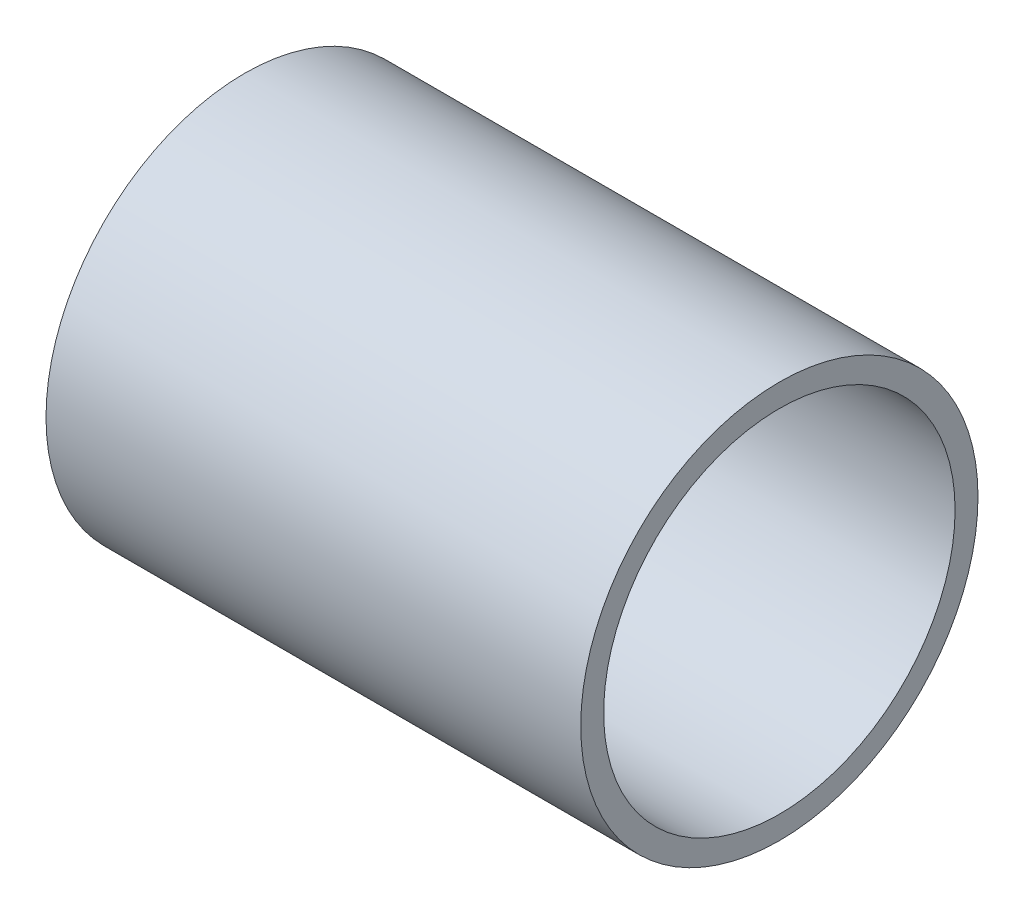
from build123d import *

# Parameters (mm, degrees)
SKETCH1_R      = 26
SKETCH1_R_2    = 23
EXTRUDE1_DEPTH = 70


with BuildPart() as part:
    # Sketch1 → Extrude1 (new body)
    with BuildSketch(Plane(origin=(0, 0, 0), x_dir=(0, 0, -1), z_dir=(1, 0, 0))):
        Circle(SKETCH1_R)
        Circle(SKETCH1_R_2, mode=Mode.SUBTRACT)
    extrude(amount=EXTRUDE1_DEPTH)


solid = part.part
